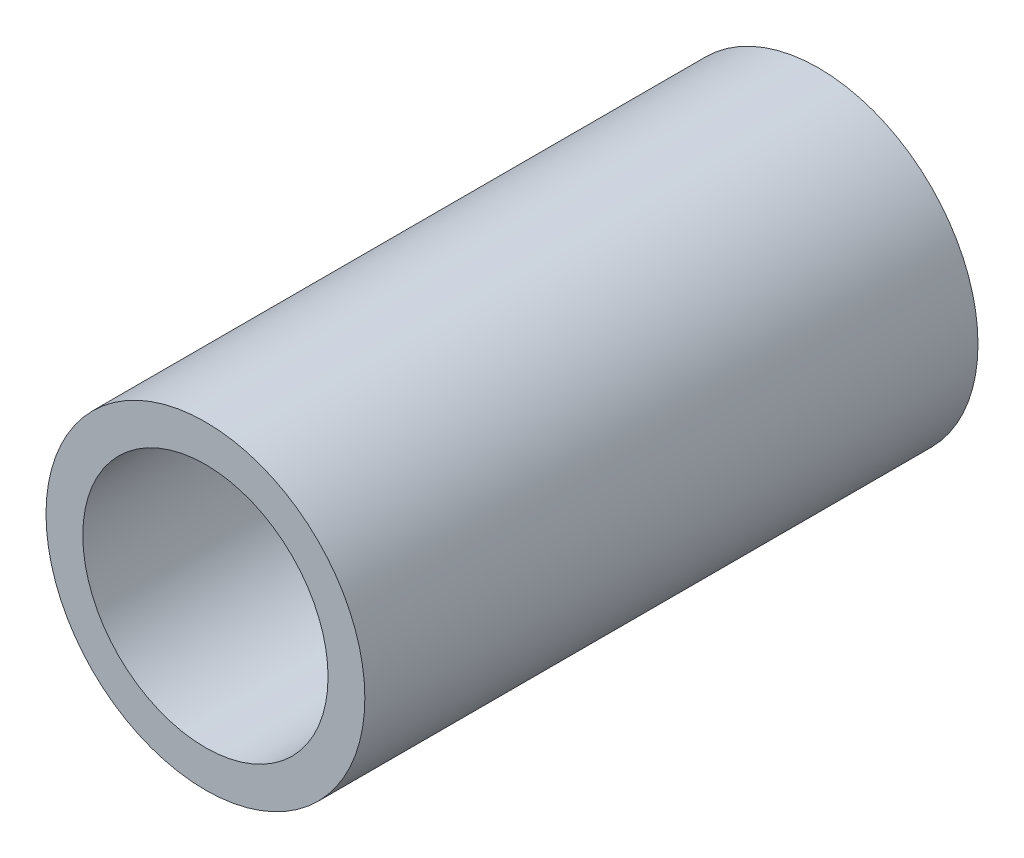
from build123d import *

# Parameters (mm, degrees)
SZKIC1_R                    = 13
SZKIC1_R_2                  = 10
DODANIE_WYCI_GNI_CIE1_DEPTH = 50


with BuildPart() as part:
    # Szkic1 → Dodanie-wyci_gni_cie1 (new body)
    with BuildSketch(Plane.XY):
        Circle(SZKIC1_R)
        Circle(SZKIC1_R_2, mode=Mode.SUBTRACT)
    extrude(amount=DODANIE_WYCI_GNI_CIE1_DEPTH)


solid = part.part
